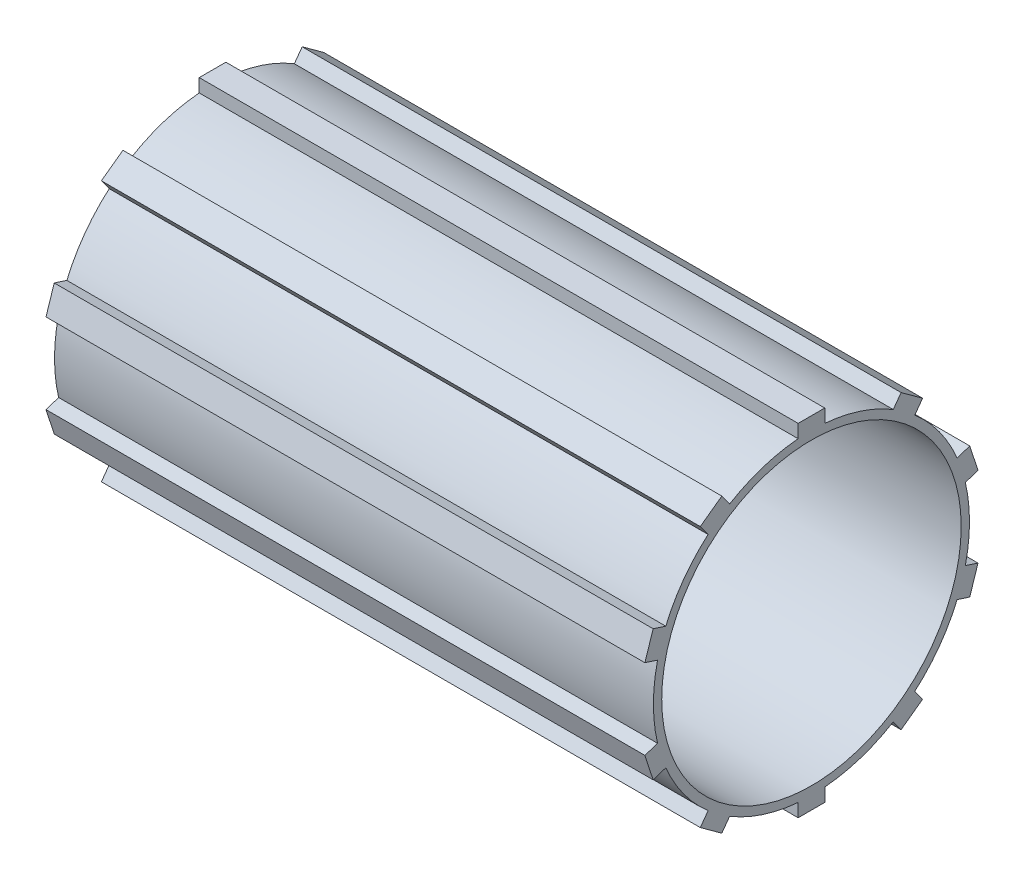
from build123d import *

# Parameters (mm, degrees)
ESQUISSE2_R                  = 23.75
ESQUISSE2_R_2                = 22.5
BOSS_EXTRU_1_DEPTH           = 90
ESQUISSE4_W                  = 4
ESQUISSE4_H                  = 2
BOSS_EXTRU_2_DEPTH           = 90
R_P_TITION_CIRCULAIRE1_COUNT = 10


with BuildPart() as part:
    # Esquisse2 → Boss.-Extru.1 (new body)
    with BuildSketch(Plane(origin=(0, 0, 0), x_dir=(0, 0, -1), z_dir=(1, 0, 0))):
        with Locations(Location((0, 0, 0), (0, 0, 180))):
            Circle(ESQUISSE2_R)
        with Locations(Location((0, 0, 0), (0, 0, 180))):
            Circle(ESQUISSE2_R_2, mode=Mode.SUBTRACT)
    extrude(amount=BOSS_EXTRU_1_DEPTH)

    # Esquisse4 → Boss.-Extru.2 (add)
    with BuildSketch(Plane(origin=(0, 0, 0), x_dir=(0, 0, -1), z_dir=(1, 0, 0))):
        with Locations((0, 24.665639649)):
            Rectangle(ESQUISSE4_W, ESQUISSE4_H)
    boss_extru_2 = extrude(amount=BOSS_EXTRU_2_DEPTH)

    # R_p_tition circulaire1: Boss.-Extru.2 ×10 about axis
    r_p_tition_circulaire1_axis = Axis((0, 0, 0), (1, 0, 0))
    for i in range(1, R_P_TITION_CIRCULAIRE1_COUNT):
        add(boss_extru_2.rotate(r_p_tition_circulaire1_axis, i * 360 / R_P_TITION_CIRCULAIRE1_COUNT))


solid = part.part
